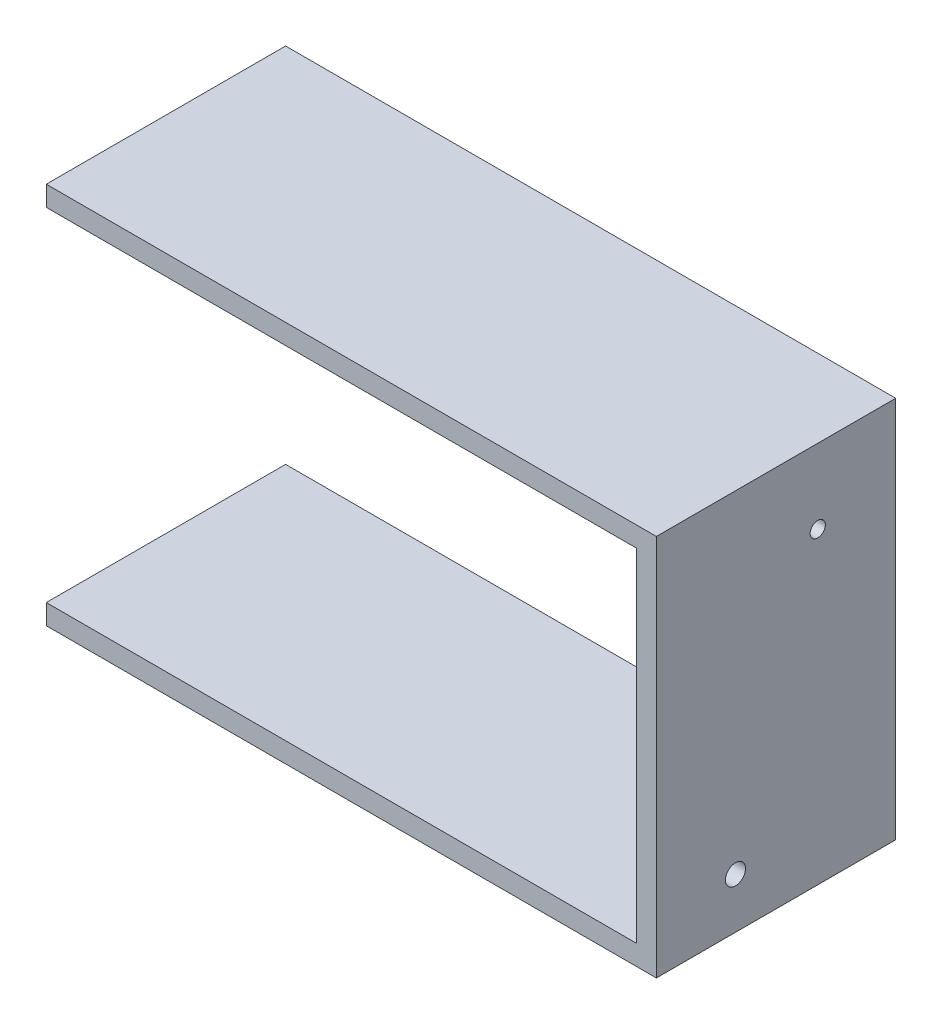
from build123d import *

# Parameters (mm, degrees)
CROQUIS1_W              = 1191.5
CROQUIS1_H              = 723
CROQUIS1_W_2            = 1115.5
CROQUIS1_H_2            = 647
SALIENTE_EXTRUIR1_DEPTH = 452.5
CROQUIS9_R              = 19
CROQUIS9_R_2            = 14.35
CORTAR_EXTRUIR2_DEPTH   = 38
CROQUIS14_R             = 4.7625
CORTAR_EXTRUIR3_DEPTH   = 70
CORTAR_EXTRUIR4_REACH   = 1467.318
CROQUIS17_W             = 38
CROQUIS17_H             = 723


with BuildPart() as part:
    # Croquis1 → Saliente-Extruir1 (new body)
    with BuildSketch(Plane.XY):
        with Locations((595.75, 361.5)):
            Rectangle(CROQUIS1_W, CROQUIS1_H)
        with Locations((595.75, 361.5)):
            Rectangle(CROQUIS1_W_2, CROQUIS1_H_2, mode=Mode.SUBTRACT)
    extrude(amount=SALIENTE_EXTRUIR1_DEPTH)

    # Croquis9 → Cortar-Extruir2 (cut)
    with BuildSketch(Plane(origin=(1191.5, 0, 0), x_dir=(0, 0, -1), z_dir=(1, 0, 0))):
        with Locations((-303, 95)):
            Circle(CROQUIS9_R)
        with Locations((-147.425, 582.452)):
            Circle(CROQUIS9_R_2)
    extrude(amount=-CORTAR_EXTRUIR2_DEPTH, mode=Mode.SUBTRACT)

    # Croquis14 → Cortar-Extruir3 (cut)
    with BuildSketch(Plane.ZY):
        with Locations((10.25, 711.75)):
            Circle(CROQUIS14_R)
        with Locations((46.25, 711.75)):
            Circle(CROQUIS14_R)
        with Locations((82.25, 711.75)):
            Circle(CROQUIS14_R)
        with Locations((118.25, 711.75)):
            Circle(CROQUIS14_R)
        with Locations((154.25, 711.75)):
            Circle(CROQUIS14_R)
        with Locations((190.25, 711.75)):
            Circle(CROQUIS14_R)
        with Locations((226.25, 711.75)):
            Circle(CROQUIS14_R)
        with Locations((262.25, 711.75)):
            Circle(CROQUIS14_R)
        with Locations((298.25, 711.75)):
            Circle(CROQUIS14_R)
        with Locations((334.25, 711.75)):
            Circle(CROQUIS14_R)
        with Locations((370.25, 711.75)):
            Circle(CROQUIS14_R)
        with Locations((406.25, 711.75)):
            Circle(CROQUIS14_R)
        with Locations((442.25, 711.75)):
            Circle(CROQUIS14_R)
        with Locations((10.25, 676.75)):
            Circle(CROQUIS14_R)
        with Locations((10.25, 641.75)):
            Circle(CROQUIS14_R)
        with Locations((10.25, 606.75)):
            Circle(CROQUIS14_R)
        with Locations((10.25, 571.75)):
            Circle(CROQUIS14_R)
        with Locations((10.25, 536.75)):
            Circle(CROQUIS14_R)
        with Locations((10.25, 501.75)):
            Circle(CROQUIS14_R)
        with Locations((10.25, 466.75)):
            Circle(CROQUIS14_R)
        with Locations((10.25, 431.75)):
            Circle(CROQUIS14_R)
        with Locations((10.25, 396.75)):
            Circle(CROQUIS14_R)
        with Locations((10.25, 361.75)):
            Circle(CROQUIS14_R)
        with Locations((10.25, 326.75)):
            Circle(CROQUIS14_R)
        with Locations((10.25, 291.75)):
            Circle(CROQUIS14_R)
        with Locations((10.25, 256.75)):
            Circle(CROQUIS14_R)
        with Locations((10.25, 221.75)):
            Circle(CROQUIS14_R)
        with Locations((10.25, 186.75)):
            Circle(CROQUIS14_R)
        with Locations((10.25, 151.75)):
            Circle(CROQUIS14_R)
        with Locations((10.25, 116.75)):
            Circle(CROQUIS14_R)
        with Locations((10.25, 81.75)):
            Circle(CROQUIS14_R)
        with Locations((10.25, 46.75)):
            Circle(CROQUIS14_R)
        with Locations((10.25, 11.75)):
            Circle(CROQUIS14_R)
        with Locations((46.25, 11.75)):
            Circle(CROQUIS14_R)
        with Locations((82.25, 11.75)):
            Circle(CROQUIS14_R)
        with Locations((118.25, 11.75)):
            Circle(CROQUIS14_R)
        with Locations((154.25, 11.75)):
            Circle(CROQUIS14_R)
        with Locations((190.25, 11.75)):
            Circle(CROQUIS14_R)
        with Locations((226.25, 11.75)):
            Circle(CROQUIS14_R)
        with Locations((262.25, 11.75)):
            Circle(CROQUIS14_R)
        with Locations((298.25, 11.75)):
            Circle(CROQUIS14_R)
        with Locations((334.25, 11.75)):
            Circle(CROQUIS14_R)
        with Locations((370.25, 11.75)):
            Circle(CROQUIS14_R)
        with Locations((406.25, 11.75)):
            Circle(CROQUIS14_R)
        with Locations((442.25, 11.75)):
            Circle(CROQUIS14_R)
        with Locations((442.25, 46.75)):
            Circle(CROQUIS14_R)
        with Locations((442.25, 81.75)):
            Circle(CROQUIS14_R)
        with Locations((442.25, 116.75)):
            Circle(CROQUIS14_R)
        with Locations((442.25, 151.75)):
            Circle(CROQUIS14_R)
        with Locations((442.25, 186.75)):
            Circle(CROQUIS14_R)
        with Locations((442.25, 221.75)):
            Circle(CROQUIS14_R)
        with Locations((442.25, 256.75)):
            Circle(CROQUIS14_R)
        with Locations((442.25, 291.75)):
            Circle(CROQUIS14_R)
        with Locations((442.25, 326.75)):
            Circle(CROQUIS14_R)
        with Locations((442.25, 361.75)):
            Circle(CROQUIS14_R)
        with Locations((442.25, 396.75)):
            Circle(CROQUIS14_R)
        with Locations((442.25, 431.75)):
            Circle(CROQUIS14_R)
        with Locations((442.25, 466.75)):
            Circle(CROQUIS14_R)
        with Locations((442.25, 501.75)):
            Circle(CROQUIS14_R)
        with Locations((442.25, 536.75)):
            Circle(CROQUIS14_R)
        with Locations((442.25, 571.75)):
            Circle(CROQUIS14_R)
        with Locations((442.25, 606.75)):
            Circle(CROQUIS14_R)
        with Locations((442.25, 641.75)):
            Circle(CROQUIS14_R)
        with Locations((442.25, 676.75)):
            Circle(CROQUIS14_R)
    extrude(amount=-CORTAR_EXTRUIR3_DEPTH, mode=Mode.SUBTRACT)

    # Croquis17 → Cortar-Extruir4 (cut, up to next)
    with BuildSketch(Plane.XY.offset(452.5), mode=Mode.PRIVATE) as cortar_extruir4_sk1:
        with Locations((19, 361.5)):
            Rectangle(CROQUIS17_W, CROQUIS17_H)
    cortar_extruir4_tool1 = extrude(cortar_extruir4_sk1.sketch, amount=-CORTAR_EXTRUIR4_REACH, mode=Mode.PRIVATE) & part.part
    add(cortar_extruir4_tool1.solids().sort_by_distance((19, 361.5, 452.5))[0], mode=Mode.SUBTRACT)


solid = part.part
